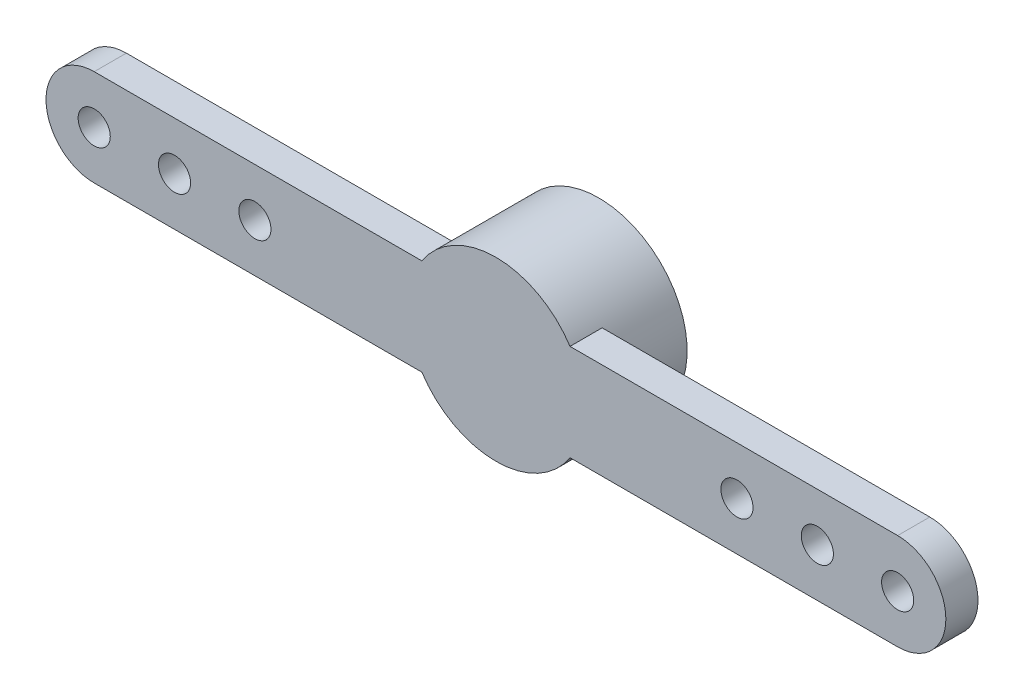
from build123d import *

# Parameters (mm, degrees)
ESQUISSE1_R                  = 0.5
EXTRUSION6_DEPTH             = 1
ESQUISSE3_R                  = 2.75
EXTRUSION8_DEPTH             = 2.2
EXTRUSION8_DIRECTION_2_REACH = 16.116
ESQUISSE4_R                  = 2
EXTRUSION9_DEPTH             = 2.6


with BuildPart() as part:
    # Esquisse1 → Extrusion6 (new body)
    with BuildSketch(Plane.XY):
        with BuildLine():
            Line((12.5, 1.5), (-12.5, 1.5))
            ThreePointArc((-12.5, 1.5), (-14, 0), (-12.5, -1.5))
            Line((-12.5, -1.5), (12.5, -1.5))
            ThreePointArc((12.5, -1.5), (14, 0), (12.5, 1.5))
        make_face()
        with Locations((-12.5, 0)):
            Circle(ESQUISSE1_R, mode=Mode.SUBTRACT)
        with Locations((-10, 0)):
            Circle(ESQUISSE1_R, mode=Mode.SUBTRACT)
        with Locations((-7.5, 0)):
            Circle(ESQUISSE1_R, mode=Mode.SUBTRACT)
        with Locations((7.5, 0)):
            Circle(ESQUISSE1_R, mode=Mode.SUBTRACT)
        with Locations((10, 0)):
            Circle(ESQUISSE1_R, mode=Mode.SUBTRACT)
        with Locations((12.5, 0)):
            Circle(ESQUISSE1_R, mode=Mode.SUBTRACT)
    extrude(amount=EXTRUSION6_DEPTH)

    # Esquisse3 → Extrusion8 (add)
    with BuildSketch(Plane(origin=(0, 0, 0), x_dir=(-1, 0, 0), z_dir=(0, 0, -1))):
        Circle(ESQUISSE3_R)
    extrude(amount=EXTRUSION8_DEPTH)

    # Extrusion8 direction 2: up to this face of the body (flat: up to its plane)
    extrusion8_direction_2_end = Plane(part.part.faces().sort_by_distance((0, 0, 1))[0])
    # Esquisse3 → Extrusion8 direction 2 (add, up to the picked face)
    with BuildSketch(Plane(origin=(0, 0, 0), x_dir=(-1, 0, 0), z_dir=(0, 0, -1)), mode=Mode.PRIVATE) as extrusion8_direction_2_sk1:
        Circle(ESQUISSE3_R)
    extrusion8_direction_2_tool1 = split(extrude(extrusion8_direction_2_sk1.sketch, amount=-EXTRUSION8_DIRECTION_2_REACH, mode=Mode.PRIVATE), bisect_by=extrusion8_direction_2_end, keep=Keep.BOTH, mode=Mode.PRIVATE)
    add(extrusion8_direction_2_tool1.solids().sort_by(Axis((0, 0, 0), (0, 0, 1)))[0])

    # Esquisse4 → Extrusion9 (cut)
    with BuildSketch(Plane(origin=(0, 0, -2.2), x_dir=(-1, 0, 0), z_dir=(0, 0, -1))):
        Circle(ESQUISSE4_R)
    extrude(amount=-EXTRUSION9_DEPTH, mode=Mode.SUBTRACT)


solid = part.part
